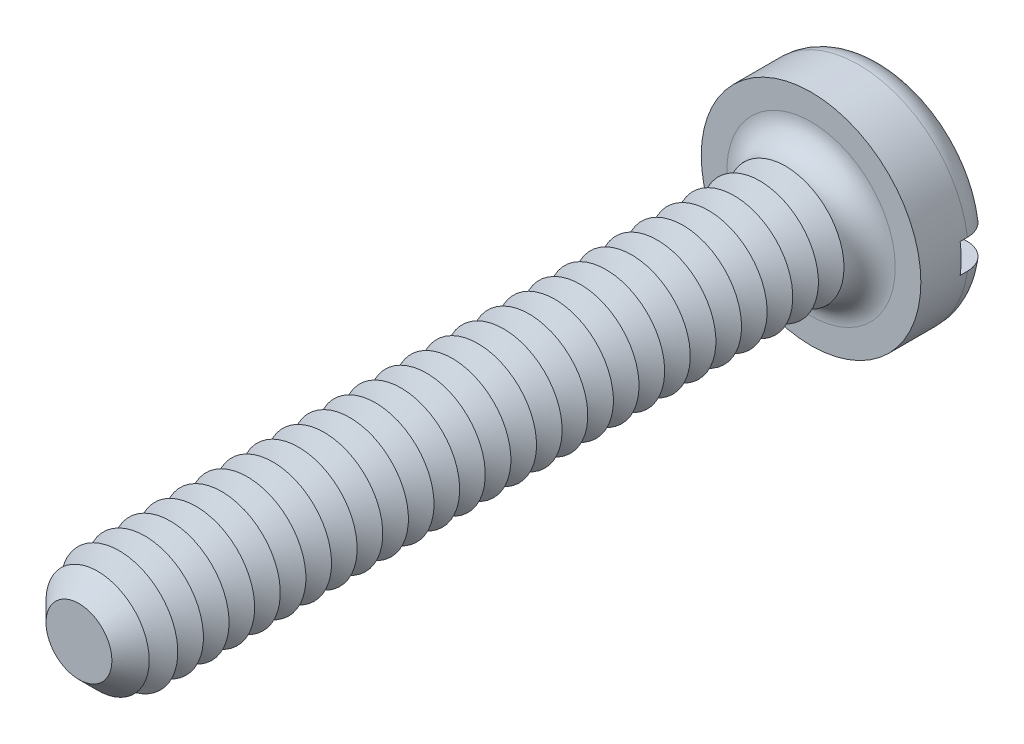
from build123d import *

# Parameters (mm, degrees)
SKETCH3_R           = 1.5
BOSS_EXTRUDE2_DEPTH = 1
SKETCH4_R           = 0.8
BOSS_EXTRUDE3_DEPTH = 10
FILLET1_R           = 0.35
CHAMFER1_SIZE       = 0.35
LPATTERN1_COUNT     = 27
LPATTERN1_PITCH     = 0.35
SKETCH8_W           = 3
SKETCH8_H           = 0.4
CUT_EXTRUDE1_DEPTH  = 0.45


with BuildPart() as part:
    # Sketch3 → Boss-Extrude2 (new body)
    with BuildSketch(Plane.XY):
        Circle(SKETCH3_R)
    extrude(amount=-BOSS_EXTRUDE2_DEPTH)

    # Sketch4 → Boss-Extrude3 (add)
    with BuildSketch(Plane.XY):
        Circle(SKETCH4_R)
    extrude(amount=BOSS_EXTRUDE3_DEPTH)

    # Fillet1
    fillet1_edges = [part.edges().sort_by_distance(p)[0] for p in [
        (-1.5, 0, -1),
        (-0.8, 0, 0),
    ]]
    fillet(fillet1_edges, radius=FILLET1_R)

    # Chamfer1
    chamfer1_edges = [part.edges().sort_by_distance(p)[0] for p in [
        (-0.8, 0, 10),
    ]]
    chamfer(chamfer1_edges, length=CHAMFER1_SIZE)

    # Sketch6 → Cut-Revolve1 (revolve, cut)
    with BuildSketch(Plane(origin=(0, 0, 0), x_dir=(0, 0, -1), z_dir=(1, 0, 0)), mode=Mode.PRIVATE) as cut_revolve1_sk:
        Polygon((-0.35, 0.8), (-0.525, 0.496891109), (-0.7, 0.8), align=None)
    cut_revolve1 = revolve(cut_revolve1_sk.sketch.rotate(Axis((0, 0, -1.694361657), (0, 0, 1)), 90), axis=Axis((0, 0, -1.694361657), (0, 0, 1)), mode=Mode.SUBTRACT)

    # LPattern1: Cut-Revolve1 ×27
    with Locations(*[(0, 0, i * LPATTERN1_PITCH) for i in range(1, LPATTERN1_COUNT)]):
        add(cut_revolve1, mode=Mode.SUBTRACT)

    # Sketch8 → Cut-Extrude1 (cut)
    with BuildSketch(Plane(origin=(0, 0, -1), x_dir=(-1, 0, 0), z_dir=(0, 0, -1))):
        Rectangle(SKETCH8_W, SKETCH8_H)
    extrude(amount=-CUT_EXTRUDE1_DEPTH, mode=Mode.SUBTRACT)


solid = part.part
